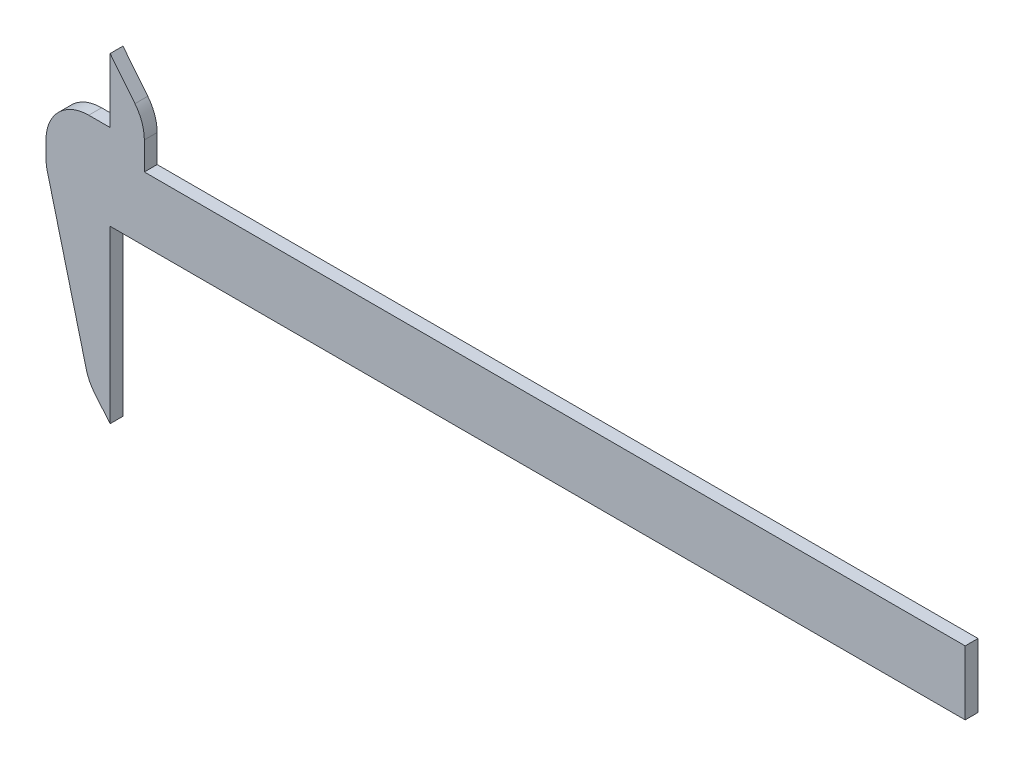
ISO-10303-21;
HEADER;
FILE_DESCRIPTION(('STEP AP214'),'2;1');
FILE_NAME('part.step','',(''),(''),'','','');
FILE_SCHEMA(('AUTOMOTIVE_DESIGN { 1 0 10303 214 1 1 1 1 }'));
ENDSEC;
DATA;
#1=APPLICATION_CONTEXT('core data for automotive mechanical design processes');
#2=APPLICATION_PROTOCOL_DEFINITION('international standard','automotive_design',2000,#1);
#3=PRODUCT_CONTEXT('',#1,'mechanical');
#4=PRODUCT('Part','Part','',(#3));
#5=PRODUCT_RELATED_PRODUCT_CATEGORY('part','',(#4));
#6=PRODUCT_DEFINITION_FORMATION('','',#4);
#7=PRODUCT_DEFINITION_CONTEXT('part definition',#1,'design');
#8=PRODUCT_DEFINITION('design','',#6,#7);
#9=PRODUCT_DEFINITION_SHAPE('','',#8);
#10=(LENGTH_UNIT() NAMED_UNIT(*) SI_UNIT(.MILLI.,.METRE.));
#11=(NAMED_UNIT(*) PLANE_ANGLE_UNIT() SI_UNIT($,.RADIAN.));
#12=(NAMED_UNIT(*) SI_UNIT($,.STERADIAN.) SOLID_ANGLE_UNIT());
#13=UNCERTAINTY_MEASURE_WITH_UNIT(LENGTH_MEASURE(1.E-05),#10,'distance_accuracy_value','');
#14=(GEOMETRIC_REPRESENTATION_CONTEXT(3) GLOBAL_UNCERTAINTY_ASSIGNED_CONTEXT((#13)) GLOBAL_UNIT_ASSIGNED_CONTEXT((#10,
#11,#12)) REPRESENTATION_CONTEXT('',''));
#15=CARTESIAN_POINT('',(0.,0.,0.));
#16=DIRECTION('',(0.,0.,1.));
#17=DIRECTION('',(1.,0.,0.));
#18=AXIS2_PLACEMENT_3D('',#15,#16,#17);
#19=CARTESIAN_POINT('',(0.,-40.,3.));
#20=DIRECTION('',(-1.,0.,0.));
#21=DIRECTION('',(0.,0.,1.));
#22=AXIS2_PLACEMENT_3D('',#19,#20,#21);
#23=PLANE('',#22);
#24=DIRECTION('',(0.,1.,0.));
#25=VECTOR('',#24,1.);
#26=CARTESIAN_POINT('',(0.,-40.,0.));
#27=LINE('',#26,#25);
#28=CARTESIAN_POINT('',(0.,-40.,0.));
#29=VERTEX_POINT('',#28);
#30=CARTESIAN_POINT('',(0.,0.,0.));
#31=VERTEX_POINT('',#30);
#32=EDGE_CURVE('E162',#29,#31,#27,.T.);
#33=ORIENTED_EDGE('',*,*,#32,.T.);
#34=DIRECTION('',(0.,0.,-1.));
#35=VECTOR('',#34,1.);
#36=CARTESIAN_POINT('',(0.,0.,3.));
#37=LINE('',#36,#35);
#38=CARTESIAN_POINT('',(0.,0.,3.));
#39=VERTEX_POINT('',#38);
#40=EDGE_CURVE('E143',#39,#31,#37,.T.);
#41=ORIENTED_EDGE('',*,*,#40,.F.);
#42=DIRECTION('',(0.,1.,0.));
#43=VECTOR('',#42,1.);
#44=CARTESIAN_POINT('',(0.,-40.,3.));
#45=LINE('',#44,#43);
#46=CARTESIAN_POINT('',(0.,-40.,3.));
#47=VERTEX_POINT('',#46);
#48=EDGE_CURVE('E150',#47,#39,#45,.T.);
#49=ORIENTED_EDGE('',*,*,#48,.F.);
#50=DIRECTION('',(0.,0.,-1.));
#51=VECTOR('',#50,1.);
#52=CARTESIAN_POINT('',(0.,-40.,3.));
#53=LINE('',#52,#51);
#54=EDGE_CURVE('E229',#47,#29,#53,.T.);
#55=ORIENTED_EDGE('',*,*,#54,.T.);
#56=EDGE_LOOP('',(#33,#41,#49,#55));
#57=FACE_BOUND('',#56,.T.);
#58=ADVANCED_FACE('F32',(#57),#23,.F.);
#59=CARTESIAN_POINT('',(0.,0.,3.));
#60=DIRECTION('',(0.,1.,0.));
#61=DIRECTION('',(0.,0.,1.));
#62=AXIS2_PLACEMENT_3D('',#59,#60,#61);
#63=PLANE('',#62);
#64=DIRECTION('',(1.,0.,0.));
#65=VECTOR('',#64,1.);
#66=CARTESIAN_POINT('',(0.,0.,0.));
#67=LINE('',#66,#65);
#68=CARTESIAN_POINT('',(200.,0.,0.));
#69=VERTEX_POINT('',#68);
#70=EDGE_CURVE('E249',#31,#69,#67,.T.);
#71=ORIENTED_EDGE('',*,*,#70,.T.);
#72=DIRECTION('',(0.,0.,-1.));
#73=VECTOR('',#72,1.);
#74=CARTESIAN_POINT('',(200.,0.,3.));
#75=LINE('',#74,#73);
#76=CARTESIAN_POINT('',(200.,0.,3.));
#77=VERTEX_POINT('',#76);
#78=EDGE_CURVE('E146',#77,#69,#75,.T.);
#79=ORIENTED_EDGE('',*,*,#78,.F.);
#80=DIRECTION('',(1.,0.,0.));
#81=VECTOR('',#80,1.);
#82=CARTESIAN_POINT('',(0.,0.,3.));
#83=LINE('',#82,#81);
#84=EDGE_CURVE('E139',#39,#77,#83,.T.);
#85=ORIENTED_EDGE('',*,*,#84,.F.);
#86=ORIENTED_EDGE('',*,*,#40,.T.);
#87=EDGE_LOOP('',(#71,#79,#85,#86));
#88=FACE_BOUND('',#87,.T.);
#89=ADVANCED_FACE('F141',(#88),#63,.F.);
#90=CARTESIAN_POINT('',(200.,0.,3.));
#91=DIRECTION('',(-1.,0.,0.));
#92=DIRECTION('',(0.,0.,1.));
#93=AXIS2_PLACEMENT_3D('',#90,#91,#92);
#94=PLANE('',#93);
#95=DIRECTION('',(0.,1.,0.));
#96=VECTOR('',#95,1.);
#97=CARTESIAN_POINT('',(200.,0.,0.));
#98=LINE('',#97,#96);
#99=CARTESIAN_POINT('',(200.,15.,0.));
#100=VERTEX_POINT('',#99);
#101=EDGE_CURVE('E248',#69,#100,#98,.T.);
#102=ORIENTED_EDGE('',*,*,#101,.T.);
#103=DIRECTION('',(0.,0.,-1.));
#104=VECTOR('',#103,1.);
#105=CARTESIAN_POINT('',(200.,15.,3.));
#106=LINE('',#105,#104);
#107=CARTESIAN_POINT('',(200.,15.,3.));
#108=VERTEX_POINT('',#107);
#109=EDGE_CURVE('E167',#108,#100,#106,.T.);
#110=ORIENTED_EDGE('',*,*,#109,.F.);
#111=DIRECTION('',(0.,1.,0.));
#112=VECTOR('',#111,1.);
#113=CARTESIAN_POINT('',(200.,0.,3.));
#114=LINE('',#113,#112);
#115=EDGE_CURVE('E149',#77,#108,#114,.T.);
#116=ORIENTED_EDGE('',*,*,#115,.F.);
#117=ORIENTED_EDGE('',*,*,#78,.T.);
#118=EDGE_LOOP('',(#102,#110,#116,#117));
#119=FACE_BOUND('',#118,.T.);
#120=ADVANCED_FACE('F270',(#119),#94,.F.);
#121=CARTESIAN_POINT('',(200.,15.,3.));
#122=DIRECTION('',(0.,-1.,0.));
#123=DIRECTION('',(1.,0.,0.));
#124=AXIS2_PLACEMENT_3D('',#121,#122,#123);
#125=PLANE('',#124);
#126=DIRECTION('',(-1.,0.,0.));
#127=VECTOR('',#126,1.);
#128=CARTESIAN_POINT('',(200.,15.,0.));
#129=LINE('',#128,#127);
#130=CARTESIAN_POINT('',(8.00000000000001,15.,0.));
#131=VERTEX_POINT('',#130);
#132=EDGE_CURVE('E216',#100,#131,#129,.T.);
#133=ORIENTED_EDGE('',*,*,#132,.T.);
#134=DIRECTION('',(0.,0.,-1.));
#135=VECTOR('',#134,1.);
#136=CARTESIAN_POINT('',(8.00000000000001,15.,3.));
#137=LINE('',#136,#135);
#138=CARTESIAN_POINT('',(8.00000000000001,15.,3.));
#139=VERTEX_POINT('',#138);
#140=EDGE_CURVE('E236',#139,#131,#137,.T.);
#141=ORIENTED_EDGE('',*,*,#140,.F.);
#142=DIRECTION('',(-1.,0.,0.));
#143=VECTOR('',#142,1.);
#144=CARTESIAN_POINT('',(200.,15.,3.));
#145=LINE('',#144,#143);
#146=EDGE_CURVE('E245',#108,#139,#145,.T.);
#147=ORIENTED_EDGE('',*,*,#146,.F.);
#148=ORIENTED_EDGE('',*,*,#109,.T.);
#149=EDGE_LOOP('',(#133,#141,#147,#148));
#150=FACE_BOUND('',#149,.T.);
#151=ADVANCED_FACE('F243',(#150),#125,.F.);
#152=CARTESIAN_POINT('',(8.00000000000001,15.,3.));
#153=DIRECTION('',(-1.,0.,0.));
#154=DIRECTION('',(0.,-1.,0.));
#155=AXIS2_PLACEMENT_3D('',#152,#153,#154);
#156=PLANE('',#155);
#157=DIRECTION('',(0.,1.,0.));
#158=VECTOR('',#157,1.);
#159=CARTESIAN_POINT('',(8.00000000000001,15.,0.));
#160=LINE('',#159,#158);
#161=CARTESIAN_POINT('',(8.,21.4921894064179,0.));
#162=VERTEX_POINT('',#161);
#163=EDGE_CURVE('E212',#131,#162,#160,.T.);
#164=ORIENTED_EDGE('',*,*,#163,.T.);
#165=DIRECTION('',(0.,0.,-1.));
#166=VECTOR('',#165,1.);
#167=CARTESIAN_POINT('',(8.,21.4921894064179,3.));
#168=LINE('',#167,#166);
#169=CARTESIAN_POINT('',(8.,21.4921894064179,3.));
#170=VERTEX_POINT('',#169);
#171=EDGE_CURVE('E40',#162,#170,#168,.F.);
#172=ORIENTED_EDGE('',*,*,#171,.T.);
#173=DIRECTION('',(0.,1.,0.));
#174=VECTOR('',#173,1.);
#175=CARTESIAN_POINT('',(8.00000000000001,15.,3.));
#176=LINE('',#175,#174);
#177=EDGE_CURVE('E267',#139,#170,#176,.T.);
#178=ORIENTED_EDGE('',*,*,#177,.F.);
#179=ORIENTED_EDGE('',*,*,#140,.T.);
#180=EDGE_LOOP('',(#164,#172,#178,#179));
#181=FACE_BOUND('',#180,.T.);
#182=ADVANCED_FACE('F277',(#181),#156,.F.);
#183=CARTESIAN_POINT('',(8.,25.,3.));
#184=DIRECTION('',(-0.78086880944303,-0.624695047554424,0.));
#185=DIRECTION('',(0.624695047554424,-0.78086880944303,0.));
#186=AXIS2_PLACEMENT_3D('',#183,#184,#185);
#187=PLANE('',#186);
#188=DIRECTION('',(-0.624695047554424,0.78086880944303,0.));
#189=VECTOR('',#188,1.);
#190=CARTESIAN_POINT('',(8.,25.,3.));
#191=LINE('',#190,#189);
#192=CARTESIAN_POINT('',(5.80868809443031,27.7391398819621,3.));
#193=VERTEX_POINT('',#192);
#194=CARTESIAN_POINT('',(0.,35.,3.));
#195=VERTEX_POINT('',#194);
#196=EDGE_CURVE('E205',#193,#195,#191,.T.);
#197=ORIENTED_EDGE('',*,*,#196,.F.);
#198=DIRECTION('',(0.,0.,-1.));
#199=VECTOR('',#198,1.);
#200=CARTESIAN_POINT('',(5.80868809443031,27.7391398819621,3.));
#201=LINE('',#200,#199);
#202=CARTESIAN_POINT('',(5.80868809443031,27.7391398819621,0.));
#203=VERTEX_POINT('',#202);
#204=EDGE_CURVE('E195',#193,#203,#201,.T.);
#205=ORIENTED_EDGE('',*,*,#204,.T.);
#206=DIRECTION('',(-0.624695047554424,0.78086880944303,0.));
#207=VECTOR('',#206,1.);
#208=CARTESIAN_POINT('',(8.,25.,0.));
#209=LINE('',#208,#207);
#210=CARTESIAN_POINT('',(0.,35.,0.));
#211=VERTEX_POINT('',#210);
#212=EDGE_CURVE('E203',#203,#211,#209,.T.);
#213=ORIENTED_EDGE('',*,*,#212,.T.);
#214=DIRECTION('',(0.,0.,-1.));
#215=VECTOR('',#214,1.);
#216=CARTESIAN_POINT('',(0.,35.,3.));
#217=LINE('',#216,#215);
#218=EDGE_CURVE('E234',#195,#211,#217,.T.);
#219=ORIENTED_EDGE('',*,*,#218,.F.);
#220=EDGE_LOOP('',(#197,#205,#213,#219));
#221=FACE_BOUND('',#220,.T.);
#222=ADVANCED_FACE('F201',(#221),#187,.F.);
#223=CARTESIAN_POINT('',(0.,35.,3.));
#224=DIRECTION('',(1.,0.,0.));
#225=DIRECTION('',(0.,1.,0.));
#226=AXIS2_PLACEMENT_3D('',#223,#224,#225);
#227=PLANE('',#226);
#228=DIRECTION('',(0.,-1.,0.));
#229=VECTOR('',#228,1.);
#230=CARTESIAN_POINT('',(0.,35.,0.));
#231=LINE('',#230,#229);
#232=CARTESIAN_POINT('',(0.,20.,0.));
#233=VERTEX_POINT('',#232);
#234=EDGE_CURVE('E211',#211,#233,#231,.T.);
#235=ORIENTED_EDGE('',*,*,#234,.T.);
#236=DIRECTION('',(0.,0.,-1.));
#237=VECTOR('',#236,1.);
#238=CARTESIAN_POINT('',(0.,20.,3.));
#239=LINE('',#238,#237);
#240=CARTESIAN_POINT('',(0.,20.,3.));
#241=VERTEX_POINT('',#240);
#242=EDGE_CURVE('E231',#241,#233,#239,.T.);
#243=ORIENTED_EDGE('',*,*,#242,.F.);
#244=DIRECTION('',(0.,-1.,0.));
#245=VECTOR('',#244,1.);
#246=CARTESIAN_POINT('',(0.,35.,3.));
#247=LINE('',#246,#245);
#248=EDGE_CURVE('E264',#195,#241,#247,.T.);
#249=ORIENTED_EDGE('',*,*,#248,.F.);
#250=ORIENTED_EDGE('',*,*,#218,.T.);
#251=EDGE_LOOP('',(#235,#243,#249,#250));
#252=FACE_BOUND('',#251,.T.);
#253=ADVANCED_FACE('F324',(#252),#227,.F.);
#254=CARTESIAN_POINT('',(0.,20.,3.));
#255=DIRECTION('',(0.,-1.,0.));
#256=DIRECTION('',(1.,0.,0.));
#257=AXIS2_PLACEMENT_3D('',#254,#255,#256);
#258=PLANE('',#257);
#259=DIRECTION('',(-1.,0.,0.));
#260=VECTOR('',#259,1.);
#261=CARTESIAN_POINT('',(0.,20.,0.));
#262=LINE('',#261,#260);
#263=CARTESIAN_POINT('',(-5.,20.,0.));
#264=VERTEX_POINT('',#263);
#265=EDGE_CURVE('E214',#233,#264,#262,.T.);
#266=ORIENTED_EDGE('',*,*,#265,.T.);
#267=DIRECTION('',(0.,0.,-1.));
#268=VECTOR('',#267,1.);
#269=CARTESIAN_POINT('',(-5.,20.,3.));
#270=LINE('',#269,#268);
#271=CARTESIAN_POINT('',(-5.,20.,3.));
#272=VERTEX_POINT('',#271);
#273=EDGE_CURVE('E193',#264,#272,#270,.F.);
#274=ORIENTED_EDGE('',*,*,#273,.T.);
#275=DIRECTION('',(-1.,0.,0.));
#276=VECTOR('',#275,1.);
#277=CARTESIAN_POINT('',(0.,20.,3.));
#278=LINE('',#277,#276);
#279=EDGE_CURVE('E261',#241,#272,#278,.T.);
#280=ORIENTED_EDGE('',*,*,#279,.F.);
#281=ORIENTED_EDGE('',*,*,#242,.T.);
#282=EDGE_LOOP('',(#266,#274,#280,#281));
#283=FACE_BOUND('',#282,.T.);
#284=ADVANCED_FACE('F320',(#283),#258,.F.);
#285=CARTESIAN_POINT('',(-15.,20.,3.));
#286=DIRECTION('',(1.,0.,0.));
#287=DIRECTION('',(0.,0.,-1.));
#288=AXIS2_PLACEMENT_3D('',#285,#286,#287);
#289=PLANE('',#288);
#290=DIRECTION('',(0.,-1.,0.));
#291=VECTOR('',#290,1.);
#292=CARTESIAN_POINT('',(-15.,20.,0.));
#293=LINE('',#292,#291);
#294=CARTESIAN_POINT('',(-15.,9.99999999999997,0.));
#295=VERTEX_POINT('',#294);
#296=CARTESIAN_POINT('',(-15.,6.26164427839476,0.));
#297=VERTEX_POINT('',#296);
#298=EDGE_CURVE('E222',#295,#297,#293,.T.);
#299=ORIENTED_EDGE('',*,*,#298,.T.);
#300=DIRECTION('',(0.,0.,-1.));
#301=VECTOR('',#300,1.);
#302=CARTESIAN_POINT('',(-15.,6.26164427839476,3.));
#303=LINE('',#302,#301);
#304=CARTESIAN_POINT('',(-15.,6.26164427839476,3.));
#305=VERTEX_POINT('',#304);
#306=EDGE_CURVE('E182',#297,#305,#303,.F.);
#307=ORIENTED_EDGE('',*,*,#306,.T.);
#308=DIRECTION('',(0.,-1.,0.));
#309=VECTOR('',#308,1.);
#310=CARTESIAN_POINT('',(-15.,20.,3.));
#311=LINE('',#310,#309);
#312=CARTESIAN_POINT('',(-15.,9.99999999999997,3.));
#313=VERTEX_POINT('',#312);
#314=EDGE_CURVE('E258',#313,#305,#311,.T.);
#315=ORIENTED_EDGE('',*,*,#314,.F.);
#316=DIRECTION('',(0.,0.,-1.));
#317=VECTOR('',#316,1.);
#318=CARTESIAN_POINT('',(-15.,9.99999999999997,3.));
#319=LINE('',#318,#317);
#320=EDGE_CURVE('E179',#313,#295,#319,.T.);
#321=ORIENTED_EDGE('',*,*,#320,.T.);
#322=EDGE_LOOP('',(#299,#307,#315,#321));
#323=FACE_BOUND('',#322,.T.);
#324=ADVANCED_FACE('F305',(#323),#289,.F.);
#325=CARTESIAN_POINT('',(-15.,4.99999999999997,3.));
#326=DIRECTION('',(0.968663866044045,0.248375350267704,0.));
#327=DIRECTION('',(-0.248375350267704,0.968663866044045,0.));
#328=AXIS2_PLACEMENT_3D('',#325,#326,#327);
#329=PLANE('',#328);
#330=DIRECTION('',(0.248375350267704,-0.968663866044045,0.));
#331=VECTOR('',#330,1.);
#332=CARTESIAN_POINT('',(-15.,4.99999999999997,3.));
#333=LINE('',#332,#331);
#334=CARTESIAN_POINT('',(-14.6866386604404,3.77789077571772,3.));
#335=VERTEX_POINT('',#334);
#336=CARTESIAN_POINT('',(-5.56028868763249,-31.8148741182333,3.));
#337=VERTEX_POINT('',#336);
#338=EDGE_CURVE('E255',#335,#337,#333,.T.);
#339=ORIENTED_EDGE('',*,*,#338,.F.);
#340=DIRECTION('',(0.,0.,-1.));
#341=VECTOR('',#340,1.);
#342=CARTESIAN_POINT('',(-14.6866386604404,3.77789077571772,3.));
#343=LINE('',#342,#341);
#344=CARTESIAN_POINT('',(-14.6866386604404,3.77789077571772,0.));
#345=VERTEX_POINT('',#344);
#346=EDGE_CURVE('E165',#335,#345,#343,.T.);
#347=ORIENTED_EDGE('',*,*,#346,.T.);
#348=DIRECTION('',(0.248375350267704,-0.968663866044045,0.));
#349=VECTOR('',#348,1.);
#350=CARTESIAN_POINT('',(-15.,4.99999999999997,0.));
#351=LINE('',#350,#349);
#352=CARTESIAN_POINT('',(-5.56028868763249,-31.8148741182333,0.));
#353=VERTEX_POINT('',#352);
#354=EDGE_CURVE('E225',#345,#353,#351,.T.);
#355=ORIENTED_EDGE('',*,*,#354,.T.);
#356=DIRECTION('',(0.,0.,-1.));
#357=VECTOR('',#356,1.);
#358=CARTESIAN_POINT('',(-5.56028868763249,-31.8148741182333,3.));
#359=LINE('',#358,#357);
#360=EDGE_CURVE('E163',#353,#337,#359,.F.);
#361=ORIENTED_EDGE('',*,*,#360,.T.);
#362=EDGE_LOOP('',(#339,#347,#355,#361));
#363=FACE_BOUND('',#362,.T.);
#364=ADVANCED_FACE('F312',(#363),#329,.F.);
#365=CARTESIAN_POINT('',(-5.,-34.,3.));
#366=DIRECTION('',(0.768221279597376,0.64018439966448,0.));
#367=DIRECTION('',(-0.64018439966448,0.768221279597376,0.));
#368=AXIS2_PLACEMENT_3D('',#365,#366,#367);
#369=PLANE('',#368);
#370=DIRECTION('',(0.64018439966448,-0.768221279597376,0.));
#371=VECTOR('',#370,1.);
#372=CARTESIAN_POINT('',(-5.,-34.,3.));
#373=LINE('',#372,#371);
#374=CARTESIAN_POINT('',(-3.5558628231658,-35.732964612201,3.));
#375=VERTEX_POINT('',#374);
#376=EDGE_CURVE('E155',#375,#47,#373,.T.);
#377=ORIENTED_EDGE('',*,*,#376,.F.);
#378=DIRECTION('',(0.,0.,-1.));
#379=VECTOR('',#378,1.);
#380=CARTESIAN_POINT('',(-3.5558628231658,-35.732964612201,3.));
#381=LINE('',#380,#379);
#382=CARTESIAN_POINT('',(-3.5558628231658,-35.732964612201,0.));
#383=VERTEX_POINT('',#382);
#384=EDGE_CURVE('E190',#375,#383,#381,.T.);
#385=ORIENTED_EDGE('',*,*,#384,.T.);
#386=DIRECTION('',(0.64018439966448,-0.768221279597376,0.));
#387=VECTOR('',#386,1.);
#388=CARTESIAN_POINT('',(-5.,-34.,0.));
#389=LINE('',#388,#387);
#390=EDGE_CURVE('E159',#383,#29,#389,.T.);
#391=ORIENTED_EDGE('',*,*,#390,.T.);
#392=ORIENTED_EDGE('',*,*,#54,.F.);
#393=EDGE_LOOP('',(#377,#385,#391,#392));
#394=FACE_BOUND('',#393,.T.);
#395=ADVANCED_FACE('F317',(#394),#369,.F.);
#396=CARTESIAN_POINT('',(0.,0.,3.));
#397=DIRECTION('',(0.,0.,-1.));
#398=DIRECTION('',(-1.,0.,0.));
#399=AXIS2_PLACEMENT_3D('',#396,#397,#398);
#400=PLANE('',#399);
#401=ORIENTED_EDGE('',*,*,#177,.T.);
#402=CARTESIAN_POINT('',(-2.,21.4921894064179,3.));
#403=DIRECTION('',(0.,0.,-1.));
#404=DIRECTION('',(-1.,0.,0.));
#405=AXIS2_PLACEMENT_3D('',#402,#403,#404);
#406=CIRCLE('',#405,10.);
#407=EDGE_CURVE('E11',#170,#193,#406,.F.);
#408=ORIENTED_EDGE('',*,*,#407,.T.);
#409=ORIENTED_EDGE('',*,*,#196,.T.);
#410=ORIENTED_EDGE('',*,*,#248,.T.);
#411=ORIENTED_EDGE('',*,*,#279,.T.);
#412=CARTESIAN_POINT('',(-5.,9.99999999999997,3.));
#413=DIRECTION('',(0.,0.,-1.));
#414=DIRECTION('',(-1.,0.,0.));
#415=AXIS2_PLACEMENT_3D('',#412,#413,#414);
#416=CIRCLE('',#415,10.);
#417=EDGE_CURVE('E184',#272,#313,#416,.F.);
#418=ORIENTED_EDGE('',*,*,#417,.T.);
#419=ORIENTED_EDGE('',*,*,#314,.T.);
#420=CARTESIAN_POINT('',(-5.,6.26164427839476,3.));
#421=DIRECTION('',(0.,0.,-1.));
#422=DIRECTION('',(-1.,0.,0.));
#423=AXIS2_PLACEMENT_3D('',#420,#421,#422);
#424=CIRCLE('',#423,10.);
#425=EDGE_CURVE('E188',#305,#335,#424,.F.);
#426=ORIENTED_EDGE('',*,*,#425,.T.);
#427=ORIENTED_EDGE('',*,*,#338,.T.);
#428=CARTESIAN_POINT('',(4.12634997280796,-29.3311206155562,3.));
#429=DIRECTION('',(0.,0.,-1.));
#430=DIRECTION('',(-1.,0.,0.));
#431=AXIS2_PLACEMENT_3D('',#428,#429,#430);
#432=CIRCLE('',#431,10.);
#433=EDGE_CURVE('E186',#337,#375,#432,.F.);
#434=ORIENTED_EDGE('',*,*,#433,.T.);
#435=ORIENTED_EDGE('',*,*,#376,.T.);
#436=ORIENTED_EDGE('',*,*,#48,.T.);
#437=ORIENTED_EDGE('',*,*,#84,.T.);
#438=ORIENTED_EDGE('',*,*,#115,.T.);
#439=ORIENTED_EDGE('',*,*,#146,.T.);
#440=EDGE_LOOP('',(#401,#408,#409,#410,#411,#418,#419,#426,#427,#434,#435,#436,#437,#438,#439));
#441=FACE_BOUND('',#440,.T.);
#442=ADVANCED_FACE('F153',(#441),#400,.F.);
#443=CARTESIAN_POINT('',(0.,0.,0.));
#444=DIRECTION('',(0.,0.,-1.));
#445=DIRECTION('',(-1.,0.,0.));
#446=AXIS2_PLACEMENT_3D('',#443,#444,#445);
#447=PLANE('',#446);
#448=ORIENTED_EDGE('',*,*,#212,.F.);
#449=CARTESIAN_POINT('',(-2.,21.4921894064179,0.));
#450=DIRECTION('',(0.,0.,-1.));
#451=DIRECTION('',(-1.,0.,0.));
#452=AXIS2_PLACEMENT_3D('',#449,#450,#451);
#453=CIRCLE('',#452,10.);
#454=EDGE_CURVE('E54',#203,#162,#453,.T.);
#455=ORIENTED_EDGE('',*,*,#454,.T.);
#456=ORIENTED_EDGE('',*,*,#163,.F.);
#457=ORIENTED_EDGE('',*,*,#132,.F.);
#458=ORIENTED_EDGE('',*,*,#101,.F.);
#459=ORIENTED_EDGE('',*,*,#70,.F.);
#460=ORIENTED_EDGE('',*,*,#32,.F.);
#461=ORIENTED_EDGE('',*,*,#390,.F.);
#462=CARTESIAN_POINT('',(4.12634997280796,-29.3311206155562,0.));
#463=DIRECTION('',(0.,0.,-1.));
#464=DIRECTION('',(-1.,0.,0.));
#465=AXIS2_PLACEMENT_3D('',#462,#463,#464);
#466=CIRCLE('',#465,10.);
#467=EDGE_CURVE('E175',#383,#353,#466,.T.);
#468=ORIENTED_EDGE('',*,*,#467,.T.);
#469=ORIENTED_EDGE('',*,*,#354,.F.);
#470=CARTESIAN_POINT('',(-5.,6.26164427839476,0.));
#471=DIRECTION('',(0.,0.,-1.));
#472=DIRECTION('',(-1.,0.,0.));
#473=AXIS2_PLACEMENT_3D('',#470,#471,#472);
#474=CIRCLE('',#473,10.);
#475=EDGE_CURVE('E177',#345,#297,#474,.T.);
#476=ORIENTED_EDGE('',*,*,#475,.T.);
#477=ORIENTED_EDGE('',*,*,#298,.F.);
#478=CARTESIAN_POINT('',(-5.,9.99999999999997,0.));
#479=DIRECTION('',(0.,0.,-1.));
#480=DIRECTION('',(-1.,0.,0.));
#481=AXIS2_PLACEMENT_3D('',#478,#479,#480);
#482=CIRCLE('',#481,10.);
#483=EDGE_CURVE('E173',#295,#264,#482,.T.);
#484=ORIENTED_EDGE('',*,*,#483,.T.);
#485=ORIENTED_EDGE('',*,*,#265,.F.);
#486=ORIENTED_EDGE('',*,*,#234,.F.);
#487=EDGE_LOOP('',(#448,#455,#456,#457,#458,#459,#460,#461,#468,#469,#476,#477,#484,#485,#486));
#488=FACE_BOUND('',#487,.T.);
#489=ADVANCED_FACE('F209',(#488),#447,.T.);
#490=CARTESIAN_POINT('',(-5.,6.26164427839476,3.));
#491=DIRECTION('',(0.,0.,-1.));
#492=DIRECTION('',(-1.,0.,0.));
#493=AXIS2_PLACEMENT_3D('',#490,#491,#492);
#494=CYLINDRICAL_SURFACE('',#493,10.);
#495=ORIENTED_EDGE('',*,*,#425,.F.);
#496=ORIENTED_EDGE('',*,*,#306,.F.);
#497=ORIENTED_EDGE('',*,*,#475,.F.);
#498=ORIENTED_EDGE('',*,*,#346,.F.);
#499=EDGE_LOOP('',(#495,#496,#497,#498));
#500=FACE_BOUND('',#499,.T.);
#501=ADVANCED_FACE('F285',(#500),#494,.T.);
#502=CARTESIAN_POINT('',(4.12634997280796,-29.3311206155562,3.));
#503=DIRECTION('',(0.,0.,-1.));
#504=DIRECTION('',(-1.,0.,0.));
#505=AXIS2_PLACEMENT_3D('',#502,#503,#504);
#506=CYLINDRICAL_SURFACE('',#505,10.);
#507=ORIENTED_EDGE('',*,*,#433,.F.);
#508=ORIENTED_EDGE('',*,*,#360,.F.);
#509=ORIENTED_EDGE('',*,*,#467,.F.);
#510=ORIENTED_EDGE('',*,*,#384,.F.);
#511=EDGE_LOOP('',(#507,#508,#509,#510));
#512=FACE_BOUND('',#511,.T.);
#513=ADVANCED_FACE('F288',(#512),#506,.T.);
#514=CARTESIAN_POINT('',(-5.,9.99999999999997,3.));
#515=DIRECTION('',(0.,0.,-1.));
#516=DIRECTION('',(-1.,0.,0.));
#517=AXIS2_PLACEMENT_3D('',#514,#515,#516);
#518=CYLINDRICAL_SURFACE('',#517,10.);
#519=ORIENTED_EDGE('',*,*,#417,.F.);
#520=ORIENTED_EDGE('',*,*,#273,.F.);
#521=ORIENTED_EDGE('',*,*,#483,.F.);
#522=ORIENTED_EDGE('',*,*,#320,.F.);
#523=EDGE_LOOP('',(#519,#520,#521,#522));
#524=FACE_BOUND('',#523,.T.);
#525=ADVANCED_FACE('F291',(#524),#518,.T.);
#526=CARTESIAN_POINT('',(-2.,21.4921894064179,3.));
#527=DIRECTION('',(0.,0.,-1.));
#528=DIRECTION('',(-1.,0.,0.));
#529=AXIS2_PLACEMENT_3D('',#526,#527,#528);
#530=CYLINDRICAL_SURFACE('',#529,10.);
#531=ORIENTED_EDGE('',*,*,#407,.F.);
#532=ORIENTED_EDGE('',*,*,#171,.F.);
#533=ORIENTED_EDGE('',*,*,#454,.F.);
#534=ORIENTED_EDGE('',*,*,#204,.F.);
#535=EDGE_LOOP('',(#531,#532,#533,#534));
#536=FACE_BOUND('',#535,.T.);
#537=ADVANCED_FACE('F34',(#536),#530,.T.);
#538=CLOSED_SHELL('',(#58,#89,#120,#151,#182,#222,#253,#284,#324,#364,#395,#442,#489,#501,#513,
#525,#537));
#539=MANIFOLD_SOLID_BREP('B2',#538);
#540=ADVANCED_BREP_SHAPE_REPRESENTATION('',(#18,#539),#14);
#541=SHAPE_DEFINITION_REPRESENTATION(#9,#540);
ENDSEC;
END-ISO-10303-21;
